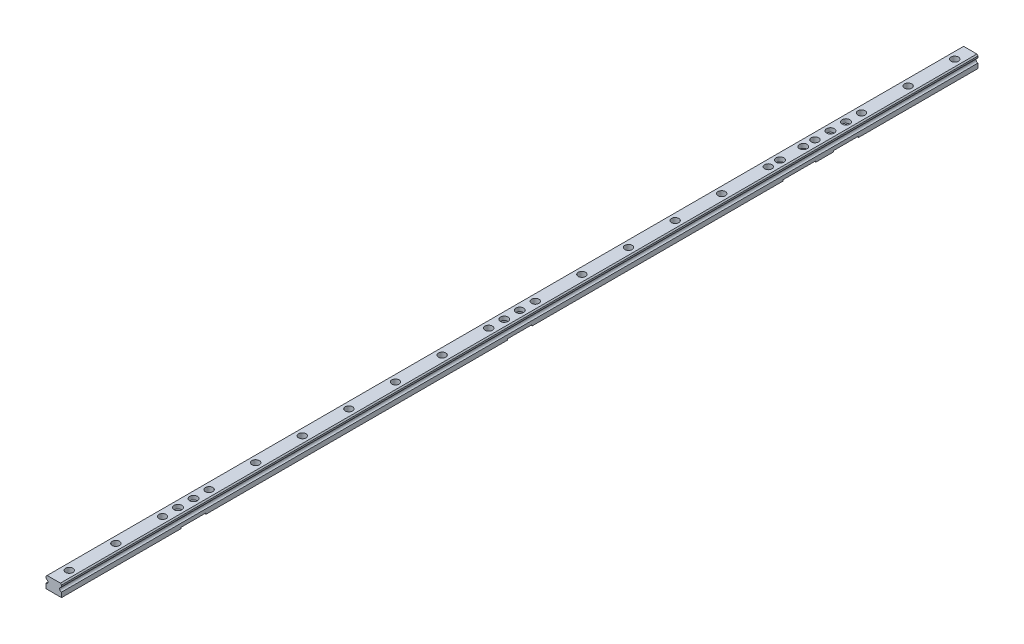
from build123d import *

# Parameters (mm, degrees)
EXTRUDE_1_DEPTH              = 200
EXTRUDE_1_DEPTH_BACK         = 980
PATTERN_LINEAR_1_COUNT       = 17
PATTERN_LINEAR_1_PITCH       = 60
SKETCH_5_W                   = 30
SKETCH_5_H                   = 32
CUT_EXTRUDE_1_DEPTH          = 1.5
HOLE_WIZARD_M5_1_D           = 5.5
HOLE_WIZARD_M5_1_CBORE_D     = 10
HOLE_WIZARD_M5_1_CBORE_DEPTH = 5
PATTERN_LINEAR_2_COUNT       = 3
PATTERN_LINEAR_2_PITCH       = 420
SKETCH_9_W                   = 20
SKETCH_9_H                   = 42
CUT_EXTRUDE_2_DEPTH          = 1.5
HOLE_WIZARD_M5_2_D           = 5.5
HOLE_WIZARD_M5_2_CBORE_D     = 10
HOLE_WIZARD_M5_2_CBORE_DEPTH = 5.5
PATTERN_LINEAR_3_COUNT       = 3
PATTERN_LINEAR_3_PITCH       = 60


with BuildPart() as part:
    # Sketch 1 → Extrude 1 (new, two sides: drawn at the far end of the back side and taken through both)
    with BuildSketch(Plane.XY.offset(-EXTRUDE_1_DEPTH_BACK)):
        with BuildLine():
            Line((-10, 0), (10, 0))
            Line((10, 0), (10, 6.18))
            ThreePointArc((10, 6.18), (7.546033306, 8.202456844), (9.0625, 10.997562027))
            ThreePointArc((9.0625, 10.997562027), (9.743734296, 11.549573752), (10, 12.388099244))
            Line((10, 12.388099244), (10, 14.043360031))
            Line((10, 14.043360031), (8.543360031, 15.5))
            Line((8.543360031, 15.5), (-8.543360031, 15.5))
            Line((-8.543360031, 15.5), (-10, 14.043360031))
            Line((-10, 14.043360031), (-10, 12.388099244))
            ThreePointArc((-10, 12.388099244), (-9.743734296, 11.549573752), (-9.0625, 10.997562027))
            ThreePointArc((-9.0625, 10.997562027), (-7.546033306, 8.202456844), (-10, 6.18))
            Line((-10, 6.18), (-10, 0))
        make_face()
    extrude(amount=EXTRUDE_1_DEPTH + EXTRUDE_1_DEPTH_BACK)

    # Sketch 2 → Cut-Revolve 1 (revolve, cut)
    with BuildSketch(Plane(origin=(0, 0, 0), x_dir=(0, 0, -1), z_dir=(1, 0, 0)), mode=Mode.PRIVATE) as cut_revolve_1_sk:
        Polygon((60, 15.5), (64.75, 15.5), (64.75, 7), (63, 7), (63, 0), (60, 0), align=None)
    revolve(cut_revolve_1_sk.sketch.rotate(Axis((0, 0, -60), (0, 1, 0)), 180), axis=Axis((0, 0, -60), (0, 1, 0)), mode=Mode.SUBTRACT)

    # Sketch 3 → Cut-Revolve 2 (revolve, cut)
    with BuildSketch(Plane(origin=(0, 0, 0), x_dir=(0, 0, -1), z_dir=(1, 0, 0)), mode=Mode.PRIVATE) as cut_revolve_2_sk:
        Polygon((-60, 15.5), (-55.25, 15.5), (-55.25, 7), (-57, 7), (-57, 0), (-60, 0), align=None)
    cut_revolve_2 = revolve(cut_revolve_2_sk.sketch.rotate(Axis((0, 0, 60), (0, 1, 0)), 180), axis=Axis((0, 0, 60), (0, 1, 0)), mode=Mode.SUBTRACT)

    # Sketch 4 → Cut-Revolve 3 (revolve, cut)
    with BuildSketch(Plane(origin=(0, 0, 0), x_dir=(0, 0, -1), z_dir=(1, 0, 0)), mode=Mode.PRIVATE) as cut_revolve_3_sk:
        Polygon((0, 15.5), (4.75, 15.5), (4.75, 7), (3, 7), (3, 0), (0, 0), align=None)
    cut_revolve_3 = revolve(cut_revolve_3_sk.sketch.rotate(Axis((0, 0, 0), (0, 1, 0)), 180), axis=Axis((0, 0, 0), (0, 1, 0)), mode=Mode.SUBTRACT)

    # Pattern Linear 1: Cut-Revolve 3 ×17
    with Locations(*[(0, 0, -i * PATTERN_LINEAR_1_PITCH) for i in range(1, PATTERN_LINEAR_1_COUNT)]):
        add(cut_revolve_3, mode=Mode.SUBTRACT)

    # Sketch 5 → Cut-Extrude 1 (cut)
    with BuildSketch(Plane.XZ):
        with Locations((0, 30)):
            Rectangle(SKETCH_5_W, SKETCH_5_H)
    cut_extrude_1 = extrude(amount=-CUT_EXTRUDE_1_DEPTH, mode=Mode.SUBTRACT)

    # Hole Wizard M5 _1 (through all)
    with Locations(Plane(origin=(1.774693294, 15.5, 2.140059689), x_dir=(1, 0, 0), z_dir=(0, 1, 0))):
        with Locations((-1.774693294, -17.859940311), (-1.774693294, -37.859940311)):
            hole_wizard_m5_1 = CounterBoreHole(HOLE_WIZARD_M5_1_D / 2, HOLE_WIZARD_M5_1_CBORE_D / 2, HOLE_WIZARD_M5_1_CBORE_DEPTH)

    # Pattern Linear 2: Cut-Extrude 1, Hole Wizard M5 _1 ×3
    with Locations(*[(0, 0, -i * PATTERN_LINEAR_2_PITCH) for i in range(1, PATTERN_LINEAR_2_COUNT)]):
        add(cut_extrude_1, mode=Mode.SUBTRACT)
        add(hole_wizard_m5_1, mode=Mode.SUBTRACT)

    # Sketch 9 → Cut-Extrude 2 (cut)
    with BuildSketch(Plane.XZ):
        with Locations((0, -750)):
            Rectangle(SKETCH_9_W, SKETCH_9_H)
    extrude(amount=-CUT_EXTRUDE_2_DEPTH, mode=Mode.SUBTRACT)

    # Hole Wizard M5 _2 (through all)
    with Locations(Plane(origin=(0, 15.5, 0), x_dir=(-1, 0, 0), z_dir=(0, 1, 0))):
        with Locations((0, -735), (0, -765)):
            CounterBoreHole(HOLE_WIZARD_M5_2_D / 2, HOLE_WIZARD_M5_2_CBORE_D / 2, HOLE_WIZARD_M5_2_CBORE_DEPTH)

    # Pattern Linear 3: Cut-Revolve 2 ×3
    with Locations(*[(0, 0, i * PATTERN_LINEAR_3_PITCH) for i in range(1, PATTERN_LINEAR_3_COUNT)]):
        add(cut_revolve_2, mode=Mode.SUBTRACT)


solid = part.part
